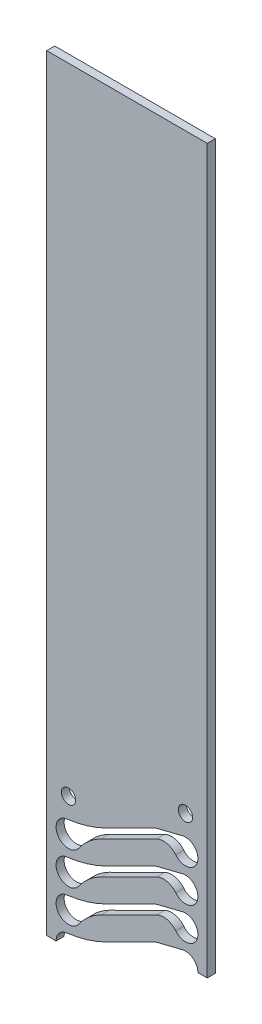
ISO-10303-21;
HEADER;
FILE_DESCRIPTION(('STEP AP214'),'2;1');
FILE_NAME('part.step','',(''),(''),'','','');
FILE_SCHEMA(('AUTOMOTIVE_DESIGN { 1 0 10303 214 1 1 1 1 }'));
ENDSEC;
DATA;
#1=APPLICATION_CONTEXT('core data for automotive mechanical design processes');
#2=APPLICATION_PROTOCOL_DEFINITION('international standard','automotive_design',2000,#1);
#3=PRODUCT_CONTEXT('',#1,'mechanical');
#4=PRODUCT('Part','Part','',(#3));
#5=PRODUCT_RELATED_PRODUCT_CATEGORY('part','',(#4));
#6=PRODUCT_DEFINITION_FORMATION('','',#4);
#7=PRODUCT_DEFINITION_CONTEXT('part definition',#1,'design');
#8=PRODUCT_DEFINITION('design','',#6,#7);
#9=PRODUCT_DEFINITION_SHAPE('','',#8);
#10=(LENGTH_UNIT() NAMED_UNIT(*) SI_UNIT(.MILLI.,.METRE.));
#11=(NAMED_UNIT(*) PLANE_ANGLE_UNIT() SI_UNIT($,.RADIAN.));
#12=(NAMED_UNIT(*) SI_UNIT($,.STERADIAN.) SOLID_ANGLE_UNIT());
#13=UNCERTAINTY_MEASURE_WITH_UNIT(LENGTH_MEASURE(1.E-05),#10,'distance_accuracy_value','');
#14=(GEOMETRIC_REPRESENTATION_CONTEXT(3) GLOBAL_UNCERTAINTY_ASSIGNED_CONTEXT((#13)) GLOBAL_UNIT_ASSIGNED_CONTEXT((#10,
#11,#12)) REPRESENTATION_CONTEXT('',''));
#15=CARTESIAN_POINT('',(0.,0.,0.));
#16=DIRECTION('',(0.,0.,1.));
#17=DIRECTION('',(1.,0.,0.));
#18=AXIS2_PLACEMENT_3D('',#15,#16,#17);
#19=CARTESIAN_POINT('',(23.1849701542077,-57.1691213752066,0.));
#20=DIRECTION('',(0.,0.,1.));
#21=DIRECTION('',(1.,0.,0.));
#22=AXIS2_PLACEMENT_3D('',#19,#20,#21);
#23=CYLINDRICAL_SURFACE('',#22,4.);
#24=DIRECTION('',(0.,0.,1.));
#25=VECTOR('',#24,1.);
#26=CARTESIAN_POINT('',(21.4001789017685,-53.5893839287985,0.));
#27=LINE('',#26,#25);
#28=CARTESIAN_POINT('',(21.4001789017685,-53.5893839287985,0.));
#29=VERTEX_POINT('',#28);
#30=CARTESIAN_POINT('',(21.4001789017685,-53.5893839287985,2.));
#31=VERTEX_POINT('',#30);
#32=EDGE_CURVE('E259',#29,#31,#27,.T.);
#33=ORIENTED_EDGE('',*,*,#32,.F.);
#34=CARTESIAN_POINT('',(23.1849701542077,-57.1691213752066,0.));
#35=DIRECTION('',(0.,0.,1.));
#36=DIRECTION('',(1.,0.,0.));
#37=AXIS2_PLACEMENT_3D('',#34,#35,#36);
#38=CIRCLE('',#37,4.);
#39=CARTESIAN_POINT('',(22.217282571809,-53.2879384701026,0.));
#40=VERTEX_POINT('',#39);
#41=EDGE_CURVE('E20',#40,#29,#38,.T.);
#42=ORIENTED_EDGE('',*,*,#41,.F.);
#43=DIRECTION('',(0.,0.,1.));
#44=VECTOR('',#43,1.);
#45=CARTESIAN_POINT('',(22.217282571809,-53.2879384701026,0.));
#46=LINE('',#45,#44);
#47=CARTESIAN_POINT('',(22.217282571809,-53.2879384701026,2.));
#48=VERTEX_POINT('',#47);
#49=EDGE_CURVE('E397',#48,#40,#46,.F.);
#50=ORIENTED_EDGE('',*,*,#49,.F.);
#51=CARTESIAN_POINT('',(23.1849701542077,-57.1691213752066,2.));
#52=DIRECTION('',(0.,0.,1.));
#53=DIRECTION('',(1.,0.,0.));
#54=AXIS2_PLACEMENT_3D('',#51,#52,#53);
#55=CIRCLE('',#54,4.);
#56=EDGE_CURVE('E260',#31,#48,#55,.F.);
#57=ORIENTED_EDGE('',*,*,#56,.F.);
#58=EDGE_LOOP('',(#33,#42,#50,#57));
#59=FACE_BOUND('',#58,.T.);
#60=ADVANCED_FACE('F17',(#59),#23,.F.);
#61=CARTESIAN_POINT('',(23.1849701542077,-32.5691213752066,0.));
#62=DIRECTION('',(0.,0.,1.));
#63=DIRECTION('',(1.,0.,0.));
#64=AXIS2_PLACEMENT_3D('',#61,#62,#63);
#65=CYLINDRICAL_SURFACE('',#64,4.);
#66=DIRECTION('',(0.,0.,1.));
#67=VECTOR('',#66,1.);
#68=CARTESIAN_POINT('',(22.217282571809,-28.6879384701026,0.));
#69=LINE('',#68,#67);
#70=CARTESIAN_POINT('',(22.217282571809,-28.6879384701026,0.));
#71=VERTEX_POINT('',#70);
#72=CARTESIAN_POINT('',(22.217282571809,-28.6879384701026,2.));
#73=VERTEX_POINT('',#72);
#74=EDGE_CURVE('E363',#71,#73,#69,.T.);
#75=ORIENTED_EDGE('',*,*,#74,.T.);
#76=CARTESIAN_POINT('',(23.1849701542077,-32.5691213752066,2.));
#77=DIRECTION('',(0.,0.,1.));
#78=DIRECTION('',(1.,0.,0.));
#79=AXIS2_PLACEMENT_3D('',#76,#77,#78);
#80=CIRCLE('',#79,4.);
#81=CARTESIAN_POINT('',(21.4001789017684,-28.9893839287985,2.));
#82=VERTEX_POINT('',#81);
#83=EDGE_CURVE('E567',#82,#73,#80,.F.);
#84=ORIENTED_EDGE('',*,*,#83,.F.);
#85=DIRECTION('',(0.,0.,1.));
#86=VECTOR('',#85,1.);
#87=CARTESIAN_POINT('',(21.4001789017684,-28.9893839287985,0.));
#88=LINE('',#87,#86);
#89=CARTESIAN_POINT('',(21.4001789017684,-28.9893839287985,0.));
#90=VERTEX_POINT('',#89);
#91=EDGE_CURVE('E366',#82,#90,#88,.F.);
#92=ORIENTED_EDGE('',*,*,#91,.T.);
#93=CARTESIAN_POINT('',(23.1849701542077,-32.5691213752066,0.));
#94=DIRECTION('',(0.,0.,1.));
#95=DIRECTION('',(1.,0.,0.));
#96=AXIS2_PLACEMENT_3D('',#93,#94,#95);
#97=CIRCLE('',#96,4.);
#98=EDGE_CURVE('E257',#71,#90,#97,.T.);
#99=ORIENTED_EDGE('',*,*,#98,.F.);
#100=EDGE_LOOP('',(#75,#84,#92,#99));
#101=FACE_BOUND('',#100,.T.);
#102=ADVANCED_FACE('F585',(#101),#65,.F.);
#103=CARTESIAN_POINT('',(23.1849701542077,-40.7691213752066,0.));
#104=DIRECTION('',(0.,0.,1.));
#105=DIRECTION('',(1.,0.,0.));
#106=AXIS2_PLACEMENT_3D('',#103,#104,#105);
#107=CYLINDRICAL_SURFACE('',#106,4.);
#108=DIRECTION('',(0.,0.,1.));
#109=VECTOR('',#108,1.);
#110=CARTESIAN_POINT('',(22.217282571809,-36.8879384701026,0.));
#111=LINE('',#110,#109);
#112=CARTESIAN_POINT('',(22.217282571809,-36.8879384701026,0.));
#113=VERTEX_POINT('',#112);
#114=CARTESIAN_POINT('',(22.217282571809,-36.8879384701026,2.));
#115=VERTEX_POINT('',#114);
#116=EDGE_CURVE('E331',#113,#115,#111,.T.);
#117=ORIENTED_EDGE('',*,*,#116,.T.);
#118=CARTESIAN_POINT('',(23.1849701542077,-40.7691213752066,2.));
#119=DIRECTION('',(0.,0.,1.));
#120=DIRECTION('',(1.,0.,0.));
#121=AXIS2_PLACEMENT_3D('',#118,#119,#120);
#122=CIRCLE('',#121,4.);
#123=CARTESIAN_POINT('',(21.4001789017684,-37.1893839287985,2.));
#124=VERTEX_POINT('',#123);
#125=EDGE_CURVE('E565',#124,#115,#122,.F.);
#126=ORIENTED_EDGE('',*,*,#125,.F.);
#127=DIRECTION('',(0.,0.,1.));
#128=VECTOR('',#127,1.);
#129=CARTESIAN_POINT('',(21.4001789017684,-37.1893839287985,0.));
#130=LINE('',#129,#128);
#131=CARTESIAN_POINT('',(21.4001789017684,-37.1893839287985,0.));
#132=VERTEX_POINT('',#131);
#133=EDGE_CURVE('E334',#124,#132,#130,.F.);
#134=ORIENTED_EDGE('',*,*,#133,.T.);
#135=CARTESIAN_POINT('',(23.1849701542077,-40.7691213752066,0.));
#136=DIRECTION('',(0.,0.,1.));
#137=DIRECTION('',(1.,0.,0.));
#138=AXIS2_PLACEMENT_3D('',#135,#136,#137);
#139=CIRCLE('',#138,4.);
#140=EDGE_CURVE('E572',#113,#132,#139,.T.);
#141=ORIENTED_EDGE('',*,*,#140,.F.);
#142=EDGE_LOOP('',(#117,#126,#134,#141));
#143=FACE_BOUND('',#142,.T.);
#144=ADVANCED_FACE('F772',(#143),#107,.F.);
#145=CARTESIAN_POINT('',(23.1849701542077,-48.9691213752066,0.));
#146=DIRECTION('',(0.,0.,1.));
#147=DIRECTION('',(1.,0.,0.));
#148=AXIS2_PLACEMENT_3D('',#145,#146,#147);
#149=CYLINDRICAL_SURFACE('',#148,4.);
#150=DIRECTION('',(0.,0.,1.));
#151=VECTOR('',#150,1.);
#152=CARTESIAN_POINT('',(22.217282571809,-45.0879384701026,0.));
#153=LINE('',#152,#151);
#154=CARTESIAN_POINT('',(22.217282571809,-45.0879384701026,0.));
#155=VERTEX_POINT('',#154);
#156=CARTESIAN_POINT('',(22.217282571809,-45.0879384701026,2.));
#157=VERTEX_POINT('',#156);
#158=EDGE_CURVE('E299',#155,#157,#153,.T.);
#159=ORIENTED_EDGE('',*,*,#158,.T.);
#160=CARTESIAN_POINT('',(23.1849701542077,-48.9691213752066,2.));
#161=DIRECTION('',(0.,0.,1.));
#162=DIRECTION('',(1.,0.,0.));
#163=AXIS2_PLACEMENT_3D('',#160,#161,#162);
#164=CIRCLE('',#163,4.);
#165=CARTESIAN_POINT('',(21.4001789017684,-45.3893839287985,2.));
#166=VERTEX_POINT('',#165);
#167=EDGE_CURVE('E448',#166,#157,#164,.F.);
#168=ORIENTED_EDGE('',*,*,#167,.F.);
#169=DIRECTION('',(0.,0.,1.));
#170=VECTOR('',#169,1.);
#171=CARTESIAN_POINT('',(21.4001789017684,-45.3893839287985,0.));
#172=LINE('',#171,#170);
#173=CARTESIAN_POINT('',(21.4001789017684,-45.3893839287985,0.));
#174=VERTEX_POINT('',#173);
#175=EDGE_CURVE('E302',#166,#174,#172,.F.);
#176=ORIENTED_EDGE('',*,*,#175,.T.);
#177=CARTESIAN_POINT('',(23.1849701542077,-48.9691213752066,0.));
#178=DIRECTION('',(0.,0.,1.));
#179=DIRECTION('',(1.,0.,0.));
#180=AXIS2_PLACEMENT_3D('',#177,#178,#179);
#181=CIRCLE('',#180,4.);
#182=EDGE_CURVE('E570',#155,#174,#181,.T.);
#183=ORIENTED_EDGE('',*,*,#182,.F.);
#184=EDGE_LOOP('',(#159,#168,#176,#183));
#185=FACE_BOUND('',#184,.T.);
#186=ADVANCED_FACE('F764',(#185),#149,.F.);
#187=CARTESIAN_POINT('',(14.0980269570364,31.6493704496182,2.));
#188=DIRECTION('',(0.,0.,1.));
#189=DIRECTION('',(1.,0.,0.));
#190=AXIS2_PLACEMENT_3D('',#187,#188,#189);
#191=PLANE('',#190);
#192=CARTESIAN_POINT('',(23.6980574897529,-50.9481062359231,2.));
#193=DIRECTION('',(0.,0.,1.));
#194=DIRECTION('',(1.,0.,0.));
#195=AXIS2_PLACEMENT_3D('',#192,#193,#194);
#196=CIRCLE('',#195,3.9);
#197=CARTESIAN_POINT('',(21.9578860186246,-47.4578622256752,2.));
#198=VERTEX_POINT('',#197);
#199=CARTESIAN_POINT('',(26.73433281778,-48.5004477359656,2.));
#200=VERTEX_POINT('',#199);
#201=EDGE_CURVE('E293',#198,#200,#196,.F.);
#202=ORIENTED_EDGE('',*,*,#201,.F.);
#203=DIRECTION('',(0.894934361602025,0.446197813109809,0.));
#204=VECTOR('',#203,1.);
#205=CARTESIAN_POINT('',(8.14159624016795,-54.3464102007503,2.));
#206=LINE('',#205,#204);
#207=CARTESIAN_POINT('',(8.14159624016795,-54.3464102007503,2.));
#208=VERTEX_POINT('',#207);
#209=EDGE_CURVE('E287',#198,#208,#206,.F.);
#210=ORIENTED_EDGE('',*,*,#209,.T.);
#211=CARTESIAN_POINT('',(14.8345634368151,-67.7704256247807,2.));
#212=DIRECTION('',(0.,0.,1.));
#213=DIRECTION('',(1.,0.,0.));
#214=AXIS2_PLACEMENT_3D('',#211,#212,#213);
#215=CIRCLE('',#214,15.);
#216=CARTESIAN_POINT('',(2.54072633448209,-59.1761502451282,2.));
#217=VERTEX_POINT('',#216);
#218=EDGE_CURVE('E283',#217,#208,#215,.F.);
#219=ORIENTED_EDGE('',*,*,#218,.F.);
#220=CARTESIAN_POINT('',(0.,-57.4,2.));
#221=DIRECTION('',(0.,0.,1.));
#222=DIRECTION('',(1.,0.,0.));
#223=AXIS2_PLACEMENT_3D('',#220,#221,#222);
#224=CIRCLE('',#223,3.1);
#225=CARTESIAN_POINT('',(-0.377395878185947,-54.3230579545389,2.));
#226=VERTEX_POINT('',#225);
#227=EDGE_CURVE('E314',#217,#226,#224,.F.);
#228=ORIENTED_EDGE('',*,*,#227,.T.);
#229=CARTESIAN_POINT('',(-4.02961405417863,-24.5461994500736,2.));
#230=DIRECTION('',(0.,0.,1.));
#231=DIRECTION('',(1.,0.,0.));
#232=AXIS2_PLACEMENT_3D('',#229,#230,#231);
#233=CIRCLE('',#232,30.);
#234=CARTESIAN_POINT('',(9.3563203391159,-51.3942302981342,2.));
#235=VERTEX_POINT('',#234);
#236=EDGE_CURVE('E311',#235,#226,#233,.F.);
#237=ORIENTED_EDGE('',*,*,#236,.F.);
#238=DIRECTION('',(-0.894934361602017,-0.446197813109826,0.));
#239=VECTOR('',#238,1.);
#240=CARTESIAN_POINT('',(21.4001789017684,-45.3893839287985,2.));
#241=LINE('',#240,#239);
#242=EDGE_CURVE('E306',#235,#166,#241,.F.);
#243=ORIENTED_EDGE('',*,*,#242,.T.);
#244=ORIENTED_EDGE('',*,*,#167,.T.);
#245=DIRECTION('',(-0.970295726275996,-0.241921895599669,0.));
#246=VECTOR('',#245,1.);
#247=CARTESIAN_POINT('',(28.3978245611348,-43.5469562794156,2.));
#248=LINE('',#247,#246);
#249=CARTESIAN_POINT('',(28.3978245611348,-43.5469562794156,2.));
#250=VERTEX_POINT('',#249);
#251=EDGE_CURVE('E298',#157,#250,#248,.F.);
#252=ORIENTED_EDGE('',*,*,#251,.T.);
#253=CARTESIAN_POINT('',(29.1477824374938,-46.5548730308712,2.));
#254=DIRECTION('',(0.,0.,1.));
#255=DIRECTION('',(1.,0.,0.));
#256=AXIS2_PLACEMENT_3D('',#253,#254,#255);
#257=CIRCLE('',#256,3.1);
#258=EDGE_CURVE('E297',#250,#200,#257,.F.);
#259=ORIENTED_EDGE('',*,*,#258,.T.);
#260=EDGE_LOOP('',(#202,#210,#219,#228,#237,#243,#244,#252,#259));
#261=FACE_BOUND('',#260,.T.);
#262=CARTESIAN_POINT('',(23.6980574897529,-42.7481062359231,2.));
#263=DIRECTION('',(0.,0.,1.));
#264=DIRECTION('',(1.,0.,0.));
#265=AXIS2_PLACEMENT_3D('',#262,#263,#264);
#266=CIRCLE('',#265,3.9);
#267=CARTESIAN_POINT('',(21.9578860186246,-39.2578622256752,2.));
#268=VERTEX_POINT('',#267);
#269=CARTESIAN_POINT('',(26.7343328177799,-40.3004477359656,2.));
#270=VERTEX_POINT('',#269);
#271=EDGE_CURVE('E325',#268,#270,#266,.F.);
#272=ORIENTED_EDGE('',*,*,#271,.F.);
#273=DIRECTION('',(0.894934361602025,0.446197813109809,0.));
#274=VECTOR('',#273,1.);
#275=CARTESIAN_POINT('',(8.14159624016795,-46.1464102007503,2.));
#276=LINE('',#275,#274);
#277=CARTESIAN_POINT('',(8.14159624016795,-46.1464102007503,2.));
#278=VERTEX_POINT('',#277);
#279=EDGE_CURVE('E319',#268,#278,#276,.F.);
#280=ORIENTED_EDGE('',*,*,#279,.T.);
#281=CARTESIAN_POINT('',(14.8345634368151,-59.5704256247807,2.));
#282=DIRECTION('',(0.,0.,1.));
#283=DIRECTION('',(1.,0.,0.));
#284=AXIS2_PLACEMENT_3D('',#281,#282,#283);
#285=CIRCLE('',#284,15.);
#286=CARTESIAN_POINT('',(2.54072633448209,-50.9761502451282,2.));
#287=VERTEX_POINT('',#286);
#288=EDGE_CURVE('E315',#287,#278,#285,.F.);
#289=ORIENTED_EDGE('',*,*,#288,.F.);
#290=CARTESIAN_POINT('',(0.,-49.2,2.));
#291=DIRECTION('',(0.,0.,1.));
#292=DIRECTION('',(1.,0.,0.));
#293=AXIS2_PLACEMENT_3D('',#290,#291,#292);
#294=CIRCLE('',#293,3.1);
#295=CARTESIAN_POINT('',(-0.377395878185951,-46.1230579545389,2.));
#296=VERTEX_POINT('',#295);
#297=EDGE_CURVE('E346',#287,#296,#294,.F.);
#298=ORIENTED_EDGE('',*,*,#297,.T.);
#299=CARTESIAN_POINT('',(-4.02961405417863,-16.3461994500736,2.));
#300=DIRECTION('',(0.,0.,1.));
#301=DIRECTION('',(1.,0.,0.));
#302=AXIS2_PLACEMENT_3D('',#299,#300,#301);
#303=CIRCLE('',#302,30.);
#304=CARTESIAN_POINT('',(9.3563203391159,-43.1942302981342,2.));
#305=VERTEX_POINT('',#304);
#306=EDGE_CURVE('E343',#305,#296,#303,.F.);
#307=ORIENTED_EDGE('',*,*,#306,.F.);
#308=DIRECTION('',(-0.894934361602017,-0.446197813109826,0.));
#309=VECTOR('',#308,1.);
#310=CARTESIAN_POINT('',(21.4001789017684,-37.1893839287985,2.));
#311=LINE('',#310,#309);
#312=EDGE_CURVE('E338',#305,#124,#311,.F.);
#313=ORIENTED_EDGE('',*,*,#312,.T.);
#314=ORIENTED_EDGE('',*,*,#125,.T.);
#315=DIRECTION('',(-0.970295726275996,-0.241921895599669,0.));
#316=VECTOR('',#315,1.);
#317=CARTESIAN_POINT('',(28.3978245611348,-35.3469562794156,2.));
#318=LINE('',#317,#316);
#319=CARTESIAN_POINT('',(28.3978245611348,-35.3469562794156,2.));
#320=VERTEX_POINT('',#319);
#321=EDGE_CURVE('E330',#115,#320,#318,.F.);
#322=ORIENTED_EDGE('',*,*,#321,.T.);
#323=CARTESIAN_POINT('',(29.1477824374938,-38.3548730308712,2.));
#324=DIRECTION('',(0.,0.,1.));
#325=DIRECTION('',(1.,0.,0.));
#326=AXIS2_PLACEMENT_3D('',#323,#324,#325);
#327=CIRCLE('',#326,3.1);
#328=EDGE_CURVE('E329',#320,#270,#327,.F.);
#329=ORIENTED_EDGE('',*,*,#328,.T.);
#330=EDGE_LOOP('',(#272,#280,#289,#298,#307,#313,#314,#322,#329));
#331=FACE_BOUND('',#330,.T.);
#332=CARTESIAN_POINT('',(23.6980574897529,-34.5481062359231,2.));
#333=DIRECTION('',(0.,0.,1.));
#334=DIRECTION('',(1.,0.,0.));
#335=AXIS2_PLACEMENT_3D('',#332,#333,#334);
#336=CIRCLE('',#335,3.9);
#337=CARTESIAN_POINT('',(21.9578860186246,-31.0578622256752,2.));
#338=VERTEX_POINT('',#337);
#339=CARTESIAN_POINT('',(26.7343328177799,-32.1004477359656,2.));
#340=VERTEX_POINT('',#339);
#341=EDGE_CURVE('E357',#338,#340,#336,.F.);
#342=ORIENTED_EDGE('',*,*,#341,.F.);
#343=DIRECTION('',(0.894934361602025,0.446197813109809,0.));
#344=VECTOR('',#343,1.);
#345=CARTESIAN_POINT('',(8.14159624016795,-37.9464102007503,2.));
#346=LINE('',#345,#344);
#347=CARTESIAN_POINT('',(8.14159624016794,-37.9464102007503,2.));
#348=VERTEX_POINT('',#347);
#349=EDGE_CURVE('E351',#338,#348,#346,.F.);
#350=ORIENTED_EDGE('',*,*,#349,.T.);
#351=CARTESIAN_POINT('',(14.8345634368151,-51.3704256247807,2.));
#352=DIRECTION('',(0.,0.,1.));
#353=DIRECTION('',(1.,0.,0.));
#354=AXIS2_PLACEMENT_3D('',#351,#352,#353);
#355=CIRCLE('',#354,15.);
#356=CARTESIAN_POINT('',(2.54072633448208,-42.7761502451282,2.));
#357=VERTEX_POINT('',#356);
#358=EDGE_CURVE('E347',#357,#348,#355,.F.);
#359=ORIENTED_EDGE('',*,*,#358,.F.);
#360=CARTESIAN_POINT('',(0.,-41.,2.));
#361=DIRECTION('',(0.,0.,1.));
#362=DIRECTION('',(1.,0.,0.));
#363=AXIS2_PLACEMENT_3D('',#360,#361,#362);
#364=CIRCLE('',#363,3.1);
#365=CARTESIAN_POINT('',(-0.377395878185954,-37.9230579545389,2.));
#366=VERTEX_POINT('',#365);
#367=EDGE_CURVE('E551',#357,#366,#364,.F.);
#368=ORIENTED_EDGE('',*,*,#367,.T.);
#369=CARTESIAN_POINT('',(-4.02961405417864,-8.14619945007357,2.));
#370=DIRECTION('',(0.,0.,1.));
#371=DIRECTION('',(1.,0.,0.));
#372=AXIS2_PLACEMENT_3D('',#369,#370,#371);
#373=CIRCLE('',#372,30.);
#374=CARTESIAN_POINT('',(9.35632033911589,-34.9942302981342,2.));
#375=VERTEX_POINT('',#374);
#376=EDGE_CURVE('E375',#375,#366,#373,.F.);
#377=ORIENTED_EDGE('',*,*,#376,.F.);
#378=DIRECTION('',(-0.894934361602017,-0.446197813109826,0.));
#379=VECTOR('',#378,1.);
#380=CARTESIAN_POINT('',(21.4001789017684,-28.9893839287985,2.));
#381=LINE('',#380,#379);
#382=EDGE_CURVE('E370',#375,#82,#381,.F.);
#383=ORIENTED_EDGE('',*,*,#382,.T.);
#384=ORIENTED_EDGE('',*,*,#83,.T.);
#385=DIRECTION('',(-0.970295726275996,-0.241921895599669,0.));
#386=VECTOR('',#385,1.);
#387=CARTESIAN_POINT('',(28.3978245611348,-27.1469562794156,2.));
#388=LINE('',#387,#386);
#389=CARTESIAN_POINT('',(28.3978245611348,-27.1469562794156,2.));
#390=VERTEX_POINT('',#389);
#391=EDGE_CURVE('E362',#73,#390,#388,.F.);
#392=ORIENTED_EDGE('',*,*,#391,.T.);
#393=CARTESIAN_POINT('',(29.1477824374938,-30.1548730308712,2.));
#394=DIRECTION('',(0.,0.,1.));
#395=DIRECTION('',(1.,0.,0.));
#396=AXIS2_PLACEMENT_3D('',#393,#394,#395);
#397=CIRCLE('',#396,3.1);
#398=EDGE_CURVE('E361',#390,#340,#397,.F.);
#399=ORIENTED_EDGE('',*,*,#398,.T.);
#400=EDGE_LOOP('',(#342,#350,#359,#368,#377,#383,#384,#392,#399));
#401=FACE_BOUND('',#400,.T.);
#402=CARTESIAN_POINT('',(0.,-32.8,2.));
#403=DIRECTION('',(0.,0.,1.));
#404=DIRECTION('',(1.,0.,0.));
#405=AXIS2_PLACEMENT_3D('',#402,#403,#404);
#406=CIRCLE('',#405,1.783);
#407=CARTESIAN_POINT('',(1.78299999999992,-32.8,2.));
#408=VERTEX_POINT('',#407);
#409=EDGE_CURVE('E554',#408,#408,#406,.F.);
#410=ORIENTED_EDGE('',*,*,#409,.T.);
#411=EDGE_LOOP('',(#410));
#412=FACE_BOUND('',#411,.T.);
#413=CARTESIAN_POINT('',(29.1477824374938,-21.9548730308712,2.));
#414=DIRECTION('',(0.,0.,1.));
#415=DIRECTION('',(1.,0.,0.));
#416=AXIS2_PLACEMENT_3D('',#413,#414,#415);
#417=CIRCLE('',#416,1.783);
#418=CARTESIAN_POINT('',(30.9307824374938,-21.9548730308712,2.));
#419=VERTEX_POINT('',#418);
#420=EDGE_CURVE('E421',#419,#419,#417,.F.);
#421=ORIENTED_EDGE('',*,*,#420,.T.);
#422=EDGE_LOOP('',(#421));
#423=FACE_BOUND('',#422,.T.);
#424=CARTESIAN_POINT('',(29.1477824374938,-54.7548730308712,2.));
#425=DIRECTION('',(0.,0.,1.));
#426=DIRECTION('',(1.,0.,0.));
#427=AXIS2_PLACEMENT_3D('',#424,#425,#426);
#428=CIRCLE('',#427,3.1);
#429=CARTESIAN_POINT('',(28.3978245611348,-51.7469562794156,2.));
#430=VERTEX_POINT('',#429);
#431=CARTESIAN_POINT('',(32.2477824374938,-54.7548730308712,2.));
#432=VERTEX_POINT('',#431);
#433=EDGE_CURVE('E396',#430,#432,#428,.F.);
#434=ORIENTED_EDGE('',*,*,#433,.T.);
#435=DIRECTION('',(1.,0.,0.));
#436=VECTOR('',#435,1.);
#437=CARTESIAN_POINT('',(34.5738912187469,-54.7548730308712,2.));
#438=LINE('',#437,#436);
#439=CARTESIAN_POINT('',(34.5738912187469,-54.7548730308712,2.));
#440=VERTEX_POINT('',#439);
#441=EDGE_CURVE('E379',#440,#432,#438,.F.);
#442=ORIENTED_EDGE('',*,*,#441,.F.);
#443=DIRECTION('',(0.,1.,0.));
#444=VECTOR('',#443,1.);
#445=CARTESIAN_POINT('',(34.5738912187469,125.4,2.));
#446=LINE('',#445,#444);
#447=CARTESIAN_POINT('',(34.5738912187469,125.4,2.));
#448=VERTEX_POINT('',#447);
#449=EDGE_CURVE('E378',#448,#440,#446,.F.);
#450=ORIENTED_EDGE('',*,*,#449,.F.);
#451=DIRECTION('',(1.,0.,0.));
#452=VECTOR('',#451,1.);
#453=CARTESIAN_POINT('',(-5.42610878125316,125.4,2.));
#454=LINE('',#453,#452);
#455=CARTESIAN_POINT('',(-5.42610878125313,125.4,2.));
#456=VERTEX_POINT('',#455);
#457=EDGE_CURVE('E390',#456,#448,#454,.T.);
#458=ORIENTED_EDGE('',*,*,#457,.F.);
#459=DIRECTION('',(0.,1.,0.));
#460=VECTOR('',#459,1.);
#461=CARTESIAN_POINT('',(-5.42610878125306,-65.6,2.));
#462=LINE('',#461,#460);
#463=CARTESIAN_POINT('',(-5.42610878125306,-65.6,2.));
#464=VERTEX_POINT('',#463);
#465=EDGE_CURVE('E445',#464,#456,#462,.T.);
#466=ORIENTED_EDGE('',*,*,#465,.F.);
#467=DIRECTION('',(1.,0.,0.));
#468=VECTOR('',#467,1.);
#469=CARTESIAN_POINT('',(-3.10000000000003,-65.6,2.));
#470=LINE('',#469,#468);
#471=CARTESIAN_POINT('',(-3.10000000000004,-65.6,2.));
#472=VERTEX_POINT('',#471);
#473=EDGE_CURVE('E411',#472,#464,#470,.F.);
#474=ORIENTED_EDGE('',*,*,#473,.F.);
#475=CARTESIAN_POINT('',(0.,-65.6,2.));
#476=DIRECTION('',(0.,0.,1.));
#477=DIRECTION('',(1.,0.,0.));
#478=AXIS2_PLACEMENT_3D('',#475,#476,#477);
#479=CIRCLE('',#478,3.1);
#480=CARTESIAN_POINT('',(-0.377395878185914,-62.5230579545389,2.));
#481=VERTEX_POINT('',#480);
#482=EDGE_CURVE('E407',#472,#481,#479,.F.);
#483=ORIENTED_EDGE('',*,*,#482,.T.);
#484=CARTESIAN_POINT('',(-4.0296140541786,-32.7461994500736,2.));
#485=DIRECTION('',(0.,0.,1.));
#486=DIRECTION('',(1.,0.,0.));
#487=AXIS2_PLACEMENT_3D('',#484,#485,#486);
#488=CIRCLE('',#487,30.);
#489=CARTESIAN_POINT('',(9.35632033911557,-59.5942302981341,2.));
#490=VERTEX_POINT('',#489);
#491=EDGE_CURVE('E403',#490,#481,#488,.F.);
#492=ORIENTED_EDGE('',*,*,#491,.F.);
#493=DIRECTION('',(0.894934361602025,0.446197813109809,0.));
#494=VECTOR('',#493,1.);
#495=CARTESIAN_POINT('',(21.4001789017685,-53.5893839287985,2.));
#496=LINE('',#495,#494);
#497=EDGE_CURVE('E399',#31,#490,#496,.F.);
#498=ORIENTED_EDGE('',*,*,#497,.F.);
#499=ORIENTED_EDGE('',*,*,#56,.T.);
#500=DIRECTION('',(0.970295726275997,0.241921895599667,0.));
#501=VECTOR('',#500,1.);
#502=CARTESIAN_POINT('',(28.3978245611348,-51.7469562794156,2.));
#503=LINE('',#502,#501);
#504=EDGE_CURVE('E263',#430,#48,#503,.F.);
#505=ORIENTED_EDGE('',*,*,#504,.F.);
#506=EDGE_LOOP('',(#434,#442,#450,#458,#466,#474,#483,#492,#498,#499,#505));
#507=FACE_BOUND('',#506,.T.);
#508=ADVANCED_FACE('F608',(#261,#331,#401,#412,#423,#507),#191,.T.);
#509=CARTESIAN_POINT('',(-5.42610878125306,-65.6,0.));
#510=DIRECTION('',(-1.,0.,0.));
#511=DIRECTION('',(0.,0.,1.));
#512=AXIS2_PLACEMENT_3D('',#509,#510,#511);
#513=PLANE('',#512);
#514=DIRECTION('',(0.,1.,0.));
#515=VECTOR('',#514,1.);
#516=CARTESIAN_POINT('',(-5.42610878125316,31.6493704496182,0.));
#517=LINE('',#516,#515);
#518=CARTESIAN_POINT('',(-5.42610878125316,125.4,0.));
#519=VERTEX_POINT('',#518);
#520=CARTESIAN_POINT('',(-5.42610878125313,-65.6000000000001,0.));
#521=VERTEX_POINT('',#520);
#522=EDGE_CURVE('E279',#519,#521,#517,.F.);
#523=ORIENTED_EDGE('',*,*,#522,.T.);
#524=DIRECTION('',(0.,0.,-1.));
#525=VECTOR('',#524,1.);
#526=CARTESIAN_POINT('',(-5.42610878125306,-65.6,0.));
#527=LINE('',#526,#525);
#528=EDGE_CURVE('E408',#464,#521,#527,.T.);
#529=ORIENTED_EDGE('',*,*,#528,.F.);
#530=ORIENTED_EDGE('',*,*,#465,.T.);
#531=DIRECTION('',(0.,0.,1.));
#532=VECTOR('',#531,1.);
#533=CARTESIAN_POINT('',(-5.42610878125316,125.4,0.));
#534=LINE('',#533,#532);
#535=EDGE_CURVE('E418',#519,#456,#534,.T.);
#536=ORIENTED_EDGE('',*,*,#535,.F.);
#537=EDGE_LOOP('',(#523,#529,#530,#536));
#538=FACE_BOUND('',#537,.T.);
#539=ADVANCED_FACE('F627',(#538),#513,.T.);
#540=CARTESIAN_POINT('',(-3.10000000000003,-65.6,0.));
#541=DIRECTION('',(0.,-1.,0.));
#542=DIRECTION('',(0.,0.,-1.));
#543=AXIS2_PLACEMENT_3D('',#540,#541,#542);
#544=PLANE('',#543);
#545=DIRECTION('',(1.,0.,0.));
#546=VECTOR('',#545,1.);
#547=CARTESIAN_POINT('',(14.0980269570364,-65.6000000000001,0.));
#548=LINE('',#547,#546);
#549=CARTESIAN_POINT('',(-3.10000000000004,-65.6000000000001,0.));
#550=VERTEX_POINT('',#549);
#551=EDGE_CURVE('E276',#521,#550,#548,.T.);
#552=ORIENTED_EDGE('',*,*,#551,.T.);
#553=DIRECTION('',(0.,0.,1.));
#554=VECTOR('',#553,1.);
#555=CARTESIAN_POINT('',(-3.10000000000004,-65.6,0.));
#556=LINE('',#555,#554);
#557=EDGE_CURVE('E404',#550,#472,#556,.T.);
#558=ORIENTED_EDGE('',*,*,#557,.T.);
#559=ORIENTED_EDGE('',*,*,#473,.T.);
#560=ORIENTED_EDGE('',*,*,#528,.T.);
#561=EDGE_LOOP('',(#552,#558,#559,#560));
#562=FACE_BOUND('',#561,.T.);
#563=ADVANCED_FACE('F620',(#562),#544,.T.);
#564=CARTESIAN_POINT('',(0.,-65.6,0.));
#565=DIRECTION('',(0.,0.,1.));
#566=DIRECTION('',(1.,0.,0.));
#567=AXIS2_PLACEMENT_3D('',#564,#565,#566);
#568=CYLINDRICAL_SURFACE('',#567,3.1);
#569=ORIENTED_EDGE('',*,*,#557,.F.);
#570=CARTESIAN_POINT('',(0.,-65.6,0.));
#571=DIRECTION('',(0.,0.,1.));
#572=DIRECTION('',(1.,0.,0.));
#573=AXIS2_PLACEMENT_3D('',#570,#571,#572);
#574=CIRCLE('',#573,3.1);
#575=CARTESIAN_POINT('',(-0.377395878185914,-62.5230579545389,0.));
#576=VERTEX_POINT('',#575);
#577=EDGE_CURVE('E272',#550,#576,#574,.F.);
#578=ORIENTED_EDGE('',*,*,#577,.T.);
#579=DIRECTION('',(0.,0.,1.));
#580=VECTOR('',#579,1.);
#581=CARTESIAN_POINT('',(-0.377395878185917,-62.5230579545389,0.));
#582=LINE('',#581,#580);
#583=EDGE_CURVE('E401',#481,#576,#582,.F.);
#584=ORIENTED_EDGE('',*,*,#583,.F.);
#585=ORIENTED_EDGE('',*,*,#482,.F.);
#586=EDGE_LOOP('',(#569,#578,#584,#585));
#587=FACE_BOUND('',#586,.T.);
#588=ADVANCED_FACE('F618',(#587),#568,.F.);
#589=CARTESIAN_POINT('',(-4.0296140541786,-32.7461994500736,0.));
#590=DIRECTION('',(0.,0.,1.));
#591=DIRECTION('',(1.,0.,0.));
#592=AXIS2_PLACEMENT_3D('',#589,#590,#591);
#593=CYLINDRICAL_SURFACE('',#592,30.);
#594=CARTESIAN_POINT('',(-4.0296140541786,-32.7461994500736,0.));
#595=DIRECTION('',(0.,0.,1.));
#596=DIRECTION('',(1.,0.,0.));
#597=AXIS2_PLACEMENT_3D('',#594,#595,#596);
#598=CIRCLE('',#597,30.);
#599=CARTESIAN_POINT('',(9.35632033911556,-59.5942302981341,0.));
#600=VERTEX_POINT('',#599);
#601=EDGE_CURVE('E268',#576,#600,#598,.T.);
#602=ORIENTED_EDGE('',*,*,#601,.T.);
#603=DIRECTION('',(0.,0.,1.));
#604=VECTOR('',#603,1.);
#605=CARTESIAN_POINT('',(9.35632033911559,-59.5942302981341,0.));
#606=LINE('',#605,#604);
#607=EDGE_CURVE('E264',#490,#600,#606,.F.);
#608=ORIENTED_EDGE('',*,*,#607,.F.);
#609=ORIENTED_EDGE('',*,*,#491,.T.);
#610=ORIENTED_EDGE('',*,*,#583,.T.);
#611=EDGE_LOOP('',(#602,#608,#609,#610));
#612=FACE_BOUND('',#611,.T.);
#613=ADVANCED_FACE('F614',(#612),#593,.T.);
#614=CARTESIAN_POINT('',(21.4001789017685,-53.5893839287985,0.));
#615=DIRECTION('',(0.446197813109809,-0.894934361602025,0.));
#616=DIRECTION('',(0.894934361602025,0.446197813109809,0.));
#617=AXIS2_PLACEMENT_3D('',#614,#615,#616);
#618=PLANE('',#617);
#619=DIRECTION('',(0.894934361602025,0.446197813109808,0.));
#620=VECTOR('',#619,1.);
#621=CARTESIAN_POINT('',(9.35632033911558,-59.5942302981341,0.));
#622=LINE('',#621,#620);
#623=EDGE_CURVE('E252',#600,#29,#622,.T.);
#624=ORIENTED_EDGE('',*,*,#623,.T.);
#625=ORIENTED_EDGE('',*,*,#32,.T.);
#626=ORIENTED_EDGE('',*,*,#497,.T.);
#627=ORIENTED_EDGE('',*,*,#607,.T.);
#628=EDGE_LOOP('',(#624,#625,#626,#627));
#629=FACE_BOUND('',#628,.T.);
#630=ADVANCED_FACE('F266',(#629),#618,.T.);
#631=CARTESIAN_POINT('',(28.3978245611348,-51.7469562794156,0.));
#632=DIRECTION('',(0.241921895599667,-0.970295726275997,0.));
#633=DIRECTION('',(0.970295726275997,0.241921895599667,0.));
#634=AXIS2_PLACEMENT_3D('',#631,#632,#633);
#635=PLANE('',#634);
#636=DIRECTION('',(0.970295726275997,0.241921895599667,0.));
#637=VECTOR('',#636,1.);
#638=CARTESIAN_POINT('',(22.217282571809,-53.2879384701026,0.));
#639=LINE('',#638,#637);
#640=CARTESIAN_POINT('',(28.3978245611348,-51.7469562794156,0.));
#641=VERTEX_POINT('',#640);
#642=EDGE_CURVE('E256',#40,#641,#639,.T.);
#643=ORIENTED_EDGE('',*,*,#642,.T.);
#644=DIRECTION('',(0.,0.,1.));
#645=VECTOR('',#644,1.);
#646=CARTESIAN_POINT('',(28.3978245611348,-51.7469562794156,0.));
#647=LINE('',#646,#645);
#648=EDGE_CURVE('E393',#641,#430,#647,.T.);
#649=ORIENTED_EDGE('',*,*,#648,.T.);
#650=ORIENTED_EDGE('',*,*,#504,.T.);
#651=ORIENTED_EDGE('',*,*,#49,.T.);
#652=EDGE_LOOP('',(#643,#649,#650,#651));
#653=FACE_BOUND('',#652,.T.);
#654=ADVANCED_FACE('F606',(#653),#635,.T.);
#655=CARTESIAN_POINT('',(29.1477824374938,-54.7548730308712,0.));
#656=DIRECTION('',(0.,0.,1.));
#657=DIRECTION('',(1.,0.,0.));
#658=AXIS2_PLACEMENT_3D('',#655,#656,#657);
#659=CYLINDRICAL_SURFACE('',#658,3.1);
#660=ORIENTED_EDGE('',*,*,#648,.F.);
#661=CARTESIAN_POINT('',(29.1477824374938,-54.7548730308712,0.));
#662=DIRECTION('',(0.,0.,1.));
#663=DIRECTION('',(1.,0.,0.));
#664=AXIS2_PLACEMENT_3D('',#661,#662,#663);
#665=CIRCLE('',#664,3.1);
#666=CARTESIAN_POINT('',(32.2477824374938,-54.7548730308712,0.));
#667=VERTEX_POINT('',#666);
#668=EDGE_CURVE('E270',#641,#667,#665,.F.);
#669=ORIENTED_EDGE('',*,*,#668,.T.);
#670=DIRECTION('',(0.,0.,-1.));
#671=VECTOR('',#670,1.);
#672=CARTESIAN_POINT('',(32.2477824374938,-54.7548730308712,0.));
#673=LINE('',#672,#671);
#674=EDGE_CURVE('E376',#432,#667,#673,.T.);
#675=ORIENTED_EDGE('',*,*,#674,.F.);
#676=ORIENTED_EDGE('',*,*,#433,.F.);
#677=EDGE_LOOP('',(#660,#669,#675,#676));
#678=FACE_BOUND('',#677,.T.);
#679=ADVANCED_FACE('F603',(#678),#659,.F.);
#680=CARTESIAN_POINT('',(34.5738912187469,-54.7548730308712,0.));
#681=DIRECTION('',(0.,-1.,0.));
#682=DIRECTION('',(0.,0.,-1.));
#683=AXIS2_PLACEMENT_3D('',#680,#681,#682);
#684=PLANE('',#683);
#685=DIRECTION('',(1.,0.,0.));
#686=VECTOR('',#685,1.);
#687=CARTESIAN_POINT('',(14.0980269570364,-54.7548730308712,0.));
#688=LINE('',#687,#686);
#689=CARTESIAN_POINT('',(34.5738912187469,-54.7548730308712,0.));
#690=VERTEX_POINT('',#689);
#691=EDGE_CURVE('E384',#667,#690,#688,.T.);
#692=ORIENTED_EDGE('',*,*,#691,.T.);
#693=DIRECTION('',(0.,0.,-1.));
#694=VECTOR('',#693,1.);
#695=CARTESIAN_POINT('',(34.5738912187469,-54.7548730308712,0.));
#696=LINE('',#695,#694);
#697=EDGE_CURVE('E387',#440,#690,#696,.T.);
#698=ORIENTED_EDGE('',*,*,#697,.F.);
#699=ORIENTED_EDGE('',*,*,#441,.T.);
#700=ORIENTED_EDGE('',*,*,#674,.T.);
#701=EDGE_LOOP('',(#692,#698,#699,#700));
#702=FACE_BOUND('',#701,.T.);
#703=ADVANCED_FACE('F598',(#702),#684,.T.);
#704=CARTESIAN_POINT('',(34.5738912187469,125.4,0.));
#705=DIRECTION('',(1.,0.,0.));
#706=DIRECTION('',(0.,0.,-1.));
#707=AXIS2_PLACEMENT_3D('',#704,#705,#706);
#708=PLANE('',#707);
#709=DIRECTION('',(0.,1.,0.));
#710=VECTOR('',#709,1.);
#711=CARTESIAN_POINT('',(34.5738912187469,31.6493704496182,0.));
#712=LINE('',#711,#710);
#713=CARTESIAN_POINT('',(34.5738912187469,125.4,0.));
#714=VERTEX_POINT('',#713);
#715=EDGE_CURVE('E380',#690,#714,#712,.T.);
#716=ORIENTED_EDGE('',*,*,#715,.T.);
#717=DIRECTION('',(0.,0.,1.));
#718=VECTOR('',#717,1.);
#719=CARTESIAN_POINT('',(34.5738912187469,125.4,0.));
#720=LINE('',#719,#718);
#721=EDGE_CURVE('E422',#448,#714,#720,.F.);
#722=ORIENTED_EDGE('',*,*,#721,.F.);
#723=ORIENTED_EDGE('',*,*,#449,.T.);
#724=ORIENTED_EDGE('',*,*,#697,.T.);
#725=EDGE_LOOP('',(#716,#722,#723,#724));
#726=FACE_BOUND('',#725,.T.);
#727=ADVANCED_FACE('F636',(#726),#708,.T.);
#728=CARTESIAN_POINT('',(-5.42610878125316,125.4,0.));
#729=DIRECTION('',(0.,1.,0.));
#730=DIRECTION('',(0.,0.,1.));
#731=AXIS2_PLACEMENT_3D('',#728,#729,#730);
#732=PLANE('',#731);
#733=DIRECTION('',(1.,0.,0.));
#734=VECTOR('',#733,1.);
#735=CARTESIAN_POINT('',(14.0980269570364,125.4,0.));
#736=LINE('',#735,#734);
#737=EDGE_CURVE('E383',#714,#519,#736,.F.);
#738=ORIENTED_EDGE('',*,*,#737,.T.);
#739=ORIENTED_EDGE('',*,*,#535,.T.);
#740=ORIENTED_EDGE('',*,*,#457,.T.);
#741=ORIENTED_EDGE('',*,*,#721,.T.);
#742=EDGE_LOOP('',(#738,#739,#740,#741));
#743=FACE_BOUND('',#742,.T.);
#744=ADVANCED_FACE('F632',(#743),#732,.T.);
#745=CARTESIAN_POINT('',(29.1477824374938,-21.9548730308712,0.));
#746=DIRECTION('',(0.,0.,1.));
#747=DIRECTION('',(1.,0.,0.));
#748=AXIS2_PLACEMENT_3D('',#745,#746,#747);
#749=CYLINDRICAL_SURFACE('',#748,1.783);
#750=CARTESIAN_POINT('',(29.1477824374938,-21.9548730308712,0.));
#751=DIRECTION('',(0.,0.,1.));
#752=DIRECTION('',(1.,0.,0.));
#753=AXIS2_PLACEMENT_3D('',#750,#751,#752);
#754=CIRCLE('',#753,1.783);
#755=CARTESIAN_POINT('',(30.9307824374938,-21.9548730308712,0.));
#756=VERTEX_POINT('',#755);
#757=EDGE_CURVE('E427',#756,#756,#754,.F.);
#758=ORIENTED_EDGE('',*,*,#757,.T.);
#759=EDGE_LOOP('',(#758));
#760=FACE_BOUND('',#759,.T.);
#761=ORIENTED_EDGE('',*,*,#420,.F.);
#762=EDGE_LOOP('',(#761));
#763=FACE_BOUND('',#762,.T.);
#764=ADVANCED_FACE('F647',(#760,#763),#749,.F.);
#765=CARTESIAN_POINT('',(0.,-32.8,0.));
#766=DIRECTION('',(0.,0.,1.));
#767=DIRECTION('',(1.,0.,0.));
#768=AXIS2_PLACEMENT_3D('',#765,#766,#767);
#769=CYLINDRICAL_SURFACE('',#768,1.783);
#770=CARTESIAN_POINT('',(0.,-32.8,0.));
#771=DIRECTION('',(0.,0.,1.));
#772=DIRECTION('',(1.,0.,0.));
#773=AXIS2_PLACEMENT_3D('',#770,#771,#772);
#774=CIRCLE('',#773,1.783);
#775=CARTESIAN_POINT('',(1.78299999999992,-32.8,0.));
#776=VERTEX_POINT('',#775);
#777=EDGE_CURVE('E523',#776,#776,#774,.F.);
#778=ORIENTED_EDGE('',*,*,#777,.T.);
#779=EDGE_LOOP('',(#778));
#780=FACE_BOUND('',#779,.T.);
#781=ORIENTED_EDGE('',*,*,#409,.F.);
#782=EDGE_LOOP('',(#781));
#783=FACE_BOUND('',#782,.T.);
#784=ADVANCED_FACE('F750',(#780,#783),#769,.F.);
#785=CARTESIAN_POINT('',(0.,-41.,0.));
#786=DIRECTION('',(0.,0.,1.));
#787=DIRECTION('',(1.,0.,0.));
#788=AXIS2_PLACEMENT_3D('',#785,#786,#787);
#789=CYLINDRICAL_SURFACE('',#788,3.1);
#790=DIRECTION('',(0.,0.,1.));
#791=VECTOR('',#790,1.);
#792=CARTESIAN_POINT('',(-0.377395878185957,-37.9230579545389,0.));
#793=LINE('',#792,#791);
#794=CARTESIAN_POINT('',(-0.377395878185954,-37.9230579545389,0.));
#795=VERTEX_POINT('',#794);
#796=EDGE_CURVE('E371',#366,#795,#793,.F.);
#797=ORIENTED_EDGE('',*,*,#796,.F.);
#798=ORIENTED_EDGE('',*,*,#367,.F.);
#799=DIRECTION('',(0.,0.,1.));
#800=VECTOR('',#799,1.);
#801=CARTESIAN_POINT('',(2.54072633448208,-42.7761502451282,0.));
#802=LINE('',#801,#800);
#803=CARTESIAN_POINT('',(2.54072633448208,-42.7761502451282,0.));
#804=VERTEX_POINT('',#803);
#805=EDGE_CURVE('E348',#804,#357,#802,.T.);
#806=ORIENTED_EDGE('',*,*,#805,.F.);
#807=CARTESIAN_POINT('',(0.,-41.,0.));
#808=DIRECTION('',(0.,0.,1.));
#809=DIRECTION('',(1.,0.,0.));
#810=AXIS2_PLACEMENT_3D('',#807,#808,#809);
#811=CIRCLE('',#810,3.1);
#812=EDGE_CURVE('E520',#804,#795,#811,.F.);
#813=ORIENTED_EDGE('',*,*,#812,.T.);
#814=EDGE_LOOP('',(#797,#798,#806,#813));
#815=FACE_BOUND('',#814,.T.);
#816=ADVANCED_FACE('F746',(#815),#789,.F.);
#817=CARTESIAN_POINT('',(-4.02961405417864,-8.14619945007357,0.));
#818=DIRECTION('',(0.,0.,1.));
#819=DIRECTION('',(1.,0.,0.));
#820=AXIS2_PLACEMENT_3D('',#817,#818,#819);
#821=CYLINDRICAL_SURFACE('',#820,30.);
#822=ORIENTED_EDGE('',*,*,#376,.T.);
#823=ORIENTED_EDGE('',*,*,#796,.T.);
#824=CARTESIAN_POINT('',(-4.02961405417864,-8.14619945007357,0.));
#825=DIRECTION('',(0.,0.,1.));
#826=DIRECTION('',(1.,0.,0.));
#827=AXIS2_PLACEMENT_3D('',#824,#825,#826);
#828=CIRCLE('',#827,30.);
#829=CARTESIAN_POINT('',(9.35632033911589,-34.9942302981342,0.));
#830=VERTEX_POINT('',#829);
#831=EDGE_CURVE('E516',#795,#830,#828,.T.);
#832=ORIENTED_EDGE('',*,*,#831,.T.);
#833=DIRECTION('',(0.,0.,1.));
#834=VECTOR('',#833,1.);
#835=CARTESIAN_POINT('',(9.35632033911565,-34.9942302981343,0.));
#836=LINE('',#835,#834);
#837=EDGE_CURVE('E367',#830,#375,#836,.T.);
#838=ORIENTED_EDGE('',*,*,#837,.T.);
#839=EDGE_LOOP('',(#822,#823,#832,#838));
#840=FACE_BOUND('',#839,.T.);
#841=ADVANCED_FACE('F743',(#840),#821,.T.);
#842=CARTESIAN_POINT('',(21.4001789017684,-28.9893839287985,0.));
#843=DIRECTION('',(-0.446197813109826,0.894934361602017,0.));
#844=DIRECTION('',(-0.894934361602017,-0.446197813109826,0.));
#845=AXIS2_PLACEMENT_3D('',#842,#843,#844);
#846=PLANE('',#845);
#847=ORIENTED_EDGE('',*,*,#91,.F.);
#848=ORIENTED_EDGE('',*,*,#382,.F.);
#849=ORIENTED_EDGE('',*,*,#837,.F.);
#850=DIRECTION('',(0.894934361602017,0.446197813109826,0.));
#851=VECTOR('',#850,1.);
#852=CARTESIAN_POINT('',(9.35632033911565,-34.9942302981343,0.));
#853=LINE('',#852,#851);
#854=EDGE_CURVE('E519',#830,#90,#853,.T.);
#855=ORIENTED_EDGE('',*,*,#854,.T.);
#856=EDGE_LOOP('',(#847,#848,#849,#855));
#857=FACE_BOUND('',#856,.T.);
#858=ADVANCED_FACE('F588',(#857),#846,.F.);
#859=CARTESIAN_POINT('',(28.3978245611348,-27.1469562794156,0.));
#860=DIRECTION('',(-0.241921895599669,0.970295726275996,0.));
#861=DIRECTION('',(-0.970295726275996,-0.241921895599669,0.));
#862=AXIS2_PLACEMENT_3D('',#859,#860,#861);
#863=PLANE('',#862);
#864=DIRECTION('',(0.,0.,1.));
#865=VECTOR('',#864,1.);
#866=CARTESIAN_POINT('',(28.3978245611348,-27.1469562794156,0.));
#867=LINE('',#866,#865);
#868=CARTESIAN_POINT('',(28.3978245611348,-27.1469562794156,0.));
#869=VERTEX_POINT('',#868);
#870=EDGE_CURVE('E358',#869,#390,#867,.T.);
#871=ORIENTED_EDGE('',*,*,#870,.T.);
#872=ORIENTED_EDGE('',*,*,#391,.F.);
#873=ORIENTED_EDGE('',*,*,#74,.F.);
#874=DIRECTION('',(0.970295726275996,0.241921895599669,0.));
#875=VECTOR('',#874,1.);
#876=CARTESIAN_POINT('',(22.217282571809,-28.6879384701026,0.));
#877=LINE('',#876,#875);
#878=EDGE_CURVE('E515',#71,#869,#877,.T.);
#879=ORIENTED_EDGE('',*,*,#878,.T.);
#880=EDGE_LOOP('',(#871,#872,#873,#879));
#881=FACE_BOUND('',#880,.T.);
#882=ADVANCED_FACE('F736',(#881),#863,.F.);
#883=CARTESIAN_POINT('',(29.1477824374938,-30.1548730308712,0.));
#884=DIRECTION('',(0.,0.,1.));
#885=DIRECTION('',(1.,0.,0.));
#886=AXIS2_PLACEMENT_3D('',#883,#884,#885);
#887=CYLINDRICAL_SURFACE('',#886,3.1);
#888=DIRECTION('',(0.,0.,1.));
#889=VECTOR('',#888,1.);
#890=CARTESIAN_POINT('',(26.7343328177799,-32.1004477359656,0.));
#891=LINE('',#890,#889);
#892=CARTESIAN_POINT('',(26.7343328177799,-32.1004477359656,0.));
#893=VERTEX_POINT('',#892);
#894=EDGE_CURVE('E355',#340,#893,#891,.F.);
#895=ORIENTED_EDGE('',*,*,#894,.F.);
#896=ORIENTED_EDGE('',*,*,#398,.F.);
#897=ORIENTED_EDGE('',*,*,#870,.F.);
#898=CARTESIAN_POINT('',(29.1477824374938,-30.1548730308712,0.));
#899=DIRECTION('',(0.,0.,1.));
#900=DIRECTION('',(1.,0.,0.));
#901=AXIS2_PLACEMENT_3D('',#898,#899,#900);
#902=CIRCLE('',#901,3.1);
#903=EDGE_CURVE('E512',#869,#893,#902,.F.);
#904=ORIENTED_EDGE('',*,*,#903,.T.);
#905=EDGE_LOOP('',(#895,#896,#897,#904));
#906=FACE_BOUND('',#905,.T.);
#907=ADVANCED_FACE('F732',(#906),#887,.F.);
#908=CARTESIAN_POINT('',(23.6980574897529,-34.5481062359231,0.));
#909=DIRECTION('',(0.,0.,1.));
#910=DIRECTION('',(1.,0.,0.));
#911=AXIS2_PLACEMENT_3D('',#908,#909,#910);
#912=CYLINDRICAL_SURFACE('',#911,3.9);
#913=ORIENTED_EDGE('',*,*,#341,.T.);
#914=ORIENTED_EDGE('',*,*,#894,.T.);
#915=CARTESIAN_POINT('',(23.6980574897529,-34.5481062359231,0.));
#916=DIRECTION('',(0.,0.,1.));
#917=DIRECTION('',(1.,0.,0.));
#918=AXIS2_PLACEMENT_3D('',#915,#916,#917);
#919=CIRCLE('',#918,3.9);
#920=CARTESIAN_POINT('',(21.9578860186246,-31.0578622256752,0.));
#921=VERTEX_POINT('',#920);
#922=EDGE_CURVE('E509',#893,#921,#919,.T.);
#923=ORIENTED_EDGE('',*,*,#922,.T.);
#924=DIRECTION('',(0.,0.,1.));
#925=VECTOR('',#924,1.);
#926=CARTESIAN_POINT('',(21.9578860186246,-31.0578622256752,0.));
#927=LINE('',#926,#925);
#928=EDGE_CURVE('E352',#921,#338,#927,.T.);
#929=ORIENTED_EDGE('',*,*,#928,.T.);
#930=EDGE_LOOP('',(#913,#914,#923,#929));
#931=FACE_BOUND('',#930,.T.);
#932=ADVANCED_FACE('F728',(#931),#912,.T.);
#933=CARTESIAN_POINT('',(8.14159624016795,-37.9464102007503,0.));
#934=DIRECTION('',(0.446197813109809,-0.894934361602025,0.));
#935=DIRECTION('',(0.894934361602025,0.446197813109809,0.));
#936=AXIS2_PLACEMENT_3D('',#933,#934,#935);
#937=PLANE('',#936);
#938=DIRECTION('',(0.,0.,1.));
#939=VECTOR('',#938,1.);
#940=CARTESIAN_POINT('',(8.14159624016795,-37.9464102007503,0.));
#941=LINE('',#940,#939);
#942=CARTESIAN_POINT('',(8.14159624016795,-37.9464102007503,0.));
#943=VERTEX_POINT('',#942);
#944=EDGE_CURVE('E344',#348,#943,#941,.F.);
#945=ORIENTED_EDGE('',*,*,#944,.F.);
#946=ORIENTED_EDGE('',*,*,#349,.F.);
#947=ORIENTED_EDGE('',*,*,#928,.F.);
#948=DIRECTION('',(-0.894934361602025,-0.446197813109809,0.));
#949=VECTOR('',#948,1.);
#950=CARTESIAN_POINT('',(21.9578860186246,-31.0578622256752,0.));
#951=LINE('',#950,#949);
#952=EDGE_CURVE('E508',#921,#943,#951,.T.);
#953=ORIENTED_EDGE('',*,*,#952,.T.);
#954=EDGE_LOOP('',(#945,#946,#947,#953));
#955=FACE_BOUND('',#954,.T.);
#956=ADVANCED_FACE('F724',(#955),#937,.F.);
#957=CARTESIAN_POINT('',(14.8345634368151,-51.3704256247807,0.));
#958=DIRECTION('',(0.,0.,1.));
#959=DIRECTION('',(1.,0.,0.));
#960=AXIS2_PLACEMENT_3D('',#957,#958,#959);
#961=CYLINDRICAL_SURFACE('',#960,15.);
#962=ORIENTED_EDGE('',*,*,#358,.T.);
#963=ORIENTED_EDGE('',*,*,#944,.T.);
#964=CARTESIAN_POINT('',(14.8345634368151,-51.3704256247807,0.));
#965=DIRECTION('',(0.,0.,1.));
#966=DIRECTION('',(1.,0.,0.));
#967=AXIS2_PLACEMENT_3D('',#964,#965,#966);
#968=CIRCLE('',#967,15.);
#969=EDGE_CURVE('E505',#943,#804,#968,.T.);
#970=ORIENTED_EDGE('',*,*,#969,.T.);
#971=ORIENTED_EDGE('',*,*,#805,.T.);
#972=EDGE_LOOP('',(#962,#963,#970,#971));
#973=FACE_BOUND('',#972,.T.);
#974=ADVANCED_FACE('F720',(#973),#961,.T.);
#975=CARTESIAN_POINT('',(0.,-49.2,0.));
#976=DIRECTION('',(0.,0.,1.));
#977=DIRECTION('',(1.,0.,0.));
#978=AXIS2_PLACEMENT_3D('',#975,#976,#977);
#979=CYLINDRICAL_SURFACE('',#978,3.1);
#980=DIRECTION('',(0.,0.,1.));
#981=VECTOR('',#980,1.);
#982=CARTESIAN_POINT('',(-0.377395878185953,-46.1230579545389,0.));
#983=LINE('',#982,#981);
#984=CARTESIAN_POINT('',(-0.377395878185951,-46.1230579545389,0.));
#985=VERTEX_POINT('',#984);
#986=EDGE_CURVE('E339',#296,#985,#983,.F.);
#987=ORIENTED_EDGE('',*,*,#986,.F.);
#988=ORIENTED_EDGE('',*,*,#297,.F.);
#989=DIRECTION('',(0.,0.,1.));
#990=VECTOR('',#989,1.);
#991=CARTESIAN_POINT('',(2.54072633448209,-50.9761502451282,0.));
#992=LINE('',#991,#990);
#993=CARTESIAN_POINT('',(2.54072633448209,-50.9761502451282,0.));
#994=VERTEX_POINT('',#993);
#995=EDGE_CURVE('E316',#994,#287,#992,.T.);
#996=ORIENTED_EDGE('',*,*,#995,.F.);
#997=CARTESIAN_POINT('',(0.,-49.2,0.));
#998=DIRECTION('',(0.,0.,1.));
#999=DIRECTION('',(1.,0.,0.));
#1000=AXIS2_PLACEMENT_3D('',#997,#998,#999);
#1001=CIRCLE('',#1000,3.1);
#1002=EDGE_CURVE('E502',#994,#985,#1001,.F.);
#1003=ORIENTED_EDGE('',*,*,#1002,.T.);
#1004=EDGE_LOOP('',(#987,#988,#996,#1003));
#1005=FACE_BOUND('',#1004,.T.);
#1006=ADVANCED_FACE('F716',(#1005),#979,.F.);
#1007=CARTESIAN_POINT('',(-4.02961405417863,-16.3461994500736,0.));
#1008=DIRECTION('',(0.,0.,1.));
#1009=DIRECTION('',(1.,0.,0.));
#1010=AXIS2_PLACEMENT_3D('',#1007,#1008,#1009);
#1011=CYLINDRICAL_SURFACE('',#1010,30.);
#1012=ORIENTED_EDGE('',*,*,#306,.T.);
#1013=ORIENTED_EDGE('',*,*,#986,.T.);
#1014=CARTESIAN_POINT('',(-4.02961405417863,-16.3461994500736,0.));
#1015=DIRECTION('',(0.,0.,1.));
#1016=DIRECTION('',(1.,0.,0.));
#1017=AXIS2_PLACEMENT_3D('',#1014,#1015,#1016);
#1018=CIRCLE('',#1017,30.);
#1019=CARTESIAN_POINT('',(9.35632033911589,-43.1942302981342,0.));
#1020=VERTEX_POINT('',#1019);
#1021=EDGE_CURVE('E498',#985,#1020,#1018,.T.);
#1022=ORIENTED_EDGE('',*,*,#1021,.T.);
#1023=DIRECTION('',(0.,0.,1.));
#1024=VECTOR('',#1023,1.);
#1025=CARTESIAN_POINT('',(9.35632033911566,-43.1942302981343,0.));
#1026=LINE('',#1025,#1024);
#1027=EDGE_CURVE('E335',#1020,#305,#1026,.T.);
#1028=ORIENTED_EDGE('',*,*,#1027,.T.);
#1029=EDGE_LOOP('',(#1012,#1013,#1022,#1028));
#1030=FACE_BOUND('',#1029,.T.);
#1031=ADVANCED_FACE('F712',(#1030),#1011,.T.);
#1032=CARTESIAN_POINT('',(21.4001789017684,-37.1893839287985,0.));
#1033=DIRECTION('',(-0.446197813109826,0.894934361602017,0.));
#1034=DIRECTION('',(-0.894934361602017,-0.446197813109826,0.));
#1035=AXIS2_PLACEMENT_3D('',#1032,#1033,#1034);
#1036=PLANE('',#1035);
#1037=ORIENTED_EDGE('',*,*,#133,.F.);
#1038=ORIENTED_EDGE('',*,*,#312,.F.);
#1039=ORIENTED_EDGE('',*,*,#1027,.F.);
#1040=DIRECTION('',(0.894934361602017,0.446197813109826,0.));
#1041=VECTOR('',#1040,1.);
#1042=CARTESIAN_POINT('',(9.35632033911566,-43.1942302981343,0.));
#1043=LINE('',#1042,#1041);
#1044=EDGE_CURVE('E501',#1020,#132,#1043,.T.);
#1045=ORIENTED_EDGE('',*,*,#1044,.T.);
#1046=EDGE_LOOP('',(#1037,#1038,#1039,#1045));
#1047=FACE_BOUND('',#1046,.T.);
#1048=ADVANCED_FACE('F708',(#1047),#1036,.F.);
#1049=CARTESIAN_POINT('',(28.3978245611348,-35.3469562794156,0.));
#1050=DIRECTION('',(-0.241921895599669,0.970295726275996,0.));
#1051=DIRECTION('',(-0.970295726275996,-0.241921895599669,0.));
#1052=AXIS2_PLACEMENT_3D('',#1049,#1050,#1051);
#1053=PLANE('',#1052);
#1054=DIRECTION('',(0.,0.,1.));
#1055=VECTOR('',#1054,1.);
#1056=CARTESIAN_POINT('',(28.3978245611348,-35.3469562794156,0.));
#1057=LINE('',#1056,#1055);
#1058=CARTESIAN_POINT('',(28.3978245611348,-35.3469562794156,0.));
#1059=VERTEX_POINT('',#1058);
#1060=EDGE_CURVE('E326',#1059,#320,#1057,.T.);
#1061=ORIENTED_EDGE('',*,*,#1060,.T.);
#1062=ORIENTED_EDGE('',*,*,#321,.F.);
#1063=ORIENTED_EDGE('',*,*,#116,.F.);
#1064=DIRECTION('',(0.970295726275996,0.241921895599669,0.));
#1065=VECTOR('',#1064,1.);
#1066=CARTESIAN_POINT('',(22.217282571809,-36.8879384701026,0.));
#1067=LINE('',#1066,#1065);
#1068=EDGE_CURVE('E497',#113,#1059,#1067,.T.);
#1069=ORIENTED_EDGE('',*,*,#1068,.T.);
#1070=EDGE_LOOP('',(#1061,#1062,#1063,#1069));
#1071=FACE_BOUND('',#1070,.T.);
#1072=ADVANCED_FACE('F704',(#1071),#1053,.F.);
#1073=CARTESIAN_POINT('',(29.1477824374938,-38.3548730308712,0.));
#1074=DIRECTION('',(0.,0.,1.));
#1075=DIRECTION('',(1.,0.,0.));
#1076=AXIS2_PLACEMENT_3D('',#1073,#1074,#1075);
#1077=CYLINDRICAL_SURFACE('',#1076,3.1);
#1078=DIRECTION('',(0.,0.,1.));
#1079=VECTOR('',#1078,1.);
#1080=CARTESIAN_POINT('',(26.7343328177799,-40.3004477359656,0.));
#1081=LINE('',#1080,#1079);
#1082=CARTESIAN_POINT('',(26.7343328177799,-40.3004477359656,0.));
#1083=VERTEX_POINT('',#1082);
#1084=EDGE_CURVE('E323',#270,#1083,#1081,.F.);
#1085=ORIENTED_EDGE('',*,*,#1084,.F.);
#1086=ORIENTED_EDGE('',*,*,#328,.F.);
#1087=ORIENTED_EDGE('',*,*,#1060,.F.);
#1088=CARTESIAN_POINT('',(29.1477824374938,-38.3548730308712,0.));
#1089=DIRECTION('',(0.,0.,1.));
#1090=DIRECTION('',(1.,0.,0.));
#1091=AXIS2_PLACEMENT_3D('',#1088,#1089,#1090);
#1092=CIRCLE('',#1091,3.1);
#1093=EDGE_CURVE('E494',#1059,#1083,#1092,.F.);
#1094=ORIENTED_EDGE('',*,*,#1093,.T.);
#1095=EDGE_LOOP('',(#1085,#1086,#1087,#1094));
#1096=FACE_BOUND('',#1095,.T.);
#1097=ADVANCED_FACE('F700',(#1096),#1077,.F.);
#1098=CARTESIAN_POINT('',(23.6980574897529,-42.7481062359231,0.));
#1099=DIRECTION('',(0.,0.,1.));
#1100=DIRECTION('',(1.,0.,0.));
#1101=AXIS2_PLACEMENT_3D('',#1098,#1099,#1100);
#1102=CYLINDRICAL_SURFACE('',#1101,3.9);
#1103=ORIENTED_EDGE('',*,*,#271,.T.);
#1104=ORIENTED_EDGE('',*,*,#1084,.T.);
#1105=CARTESIAN_POINT('',(23.6980574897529,-42.7481062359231,0.));
#1106=DIRECTION('',(0.,0.,1.));
#1107=DIRECTION('',(1.,0.,0.));
#1108=AXIS2_PLACEMENT_3D('',#1105,#1106,#1107);
#1109=CIRCLE('',#1108,3.9);
#1110=CARTESIAN_POINT('',(21.9578860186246,-39.2578622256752,0.));
#1111=VERTEX_POINT('',#1110);
#1112=EDGE_CURVE('E491',#1083,#1111,#1109,.T.);
#1113=ORIENTED_EDGE('',*,*,#1112,.T.);
#1114=DIRECTION('',(0.,0.,1.));
#1115=VECTOR('',#1114,1.);
#1116=CARTESIAN_POINT('',(21.9578860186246,-39.2578622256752,0.));
#1117=LINE('',#1116,#1115);
#1118=EDGE_CURVE('E320',#1111,#268,#1117,.T.);
#1119=ORIENTED_EDGE('',*,*,#1118,.T.);
#1120=EDGE_LOOP('',(#1103,#1104,#1113,#1119));
#1121=FACE_BOUND('',#1120,.T.);
#1122=ADVANCED_FACE('F696',(#1121),#1102,.T.);
#1123=CARTESIAN_POINT('',(8.14159624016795,-46.1464102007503,0.));
#1124=DIRECTION('',(0.446197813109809,-0.894934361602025,0.));
#1125=DIRECTION('',(0.894934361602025,0.446197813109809,0.));
#1126=AXIS2_PLACEMENT_3D('',#1123,#1124,#1125);
#1127=PLANE('',#1126);
#1128=DIRECTION('',(0.,0.,1.));
#1129=VECTOR('',#1128,1.);
#1130=CARTESIAN_POINT('',(8.14159624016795,-46.1464102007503,0.));
#1131=LINE('',#1130,#1129);
#1132=CARTESIAN_POINT('',(8.14159624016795,-46.1464102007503,0.));
#1133=VERTEX_POINT('',#1132);
#1134=EDGE_CURVE('E312',#278,#1133,#1131,.F.);
#1135=ORIENTED_EDGE('',*,*,#1134,.F.);
#1136=ORIENTED_EDGE('',*,*,#279,.F.);
#1137=ORIENTED_EDGE('',*,*,#1118,.F.);
#1138=DIRECTION('',(-0.894934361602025,-0.446197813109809,0.));
#1139=VECTOR('',#1138,1.);
#1140=CARTESIAN_POINT('',(21.9578860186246,-39.2578622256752,0.));
#1141=LINE('',#1140,#1139);
#1142=EDGE_CURVE('E490',#1111,#1133,#1141,.T.);
#1143=ORIENTED_EDGE('',*,*,#1142,.T.);
#1144=EDGE_LOOP('',(#1135,#1136,#1137,#1143));
#1145=FACE_BOUND('',#1144,.T.);
#1146=ADVANCED_FACE('F692',(#1145),#1127,.F.);
#1147=CARTESIAN_POINT('',(14.8345634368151,-59.5704256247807,0.));
#1148=DIRECTION('',(0.,0.,1.));
#1149=DIRECTION('',(1.,0.,0.));
#1150=AXIS2_PLACEMENT_3D('',#1147,#1148,#1149);
#1151=CYLINDRICAL_SURFACE('',#1150,15.);
#1152=ORIENTED_EDGE('',*,*,#288,.T.);
#1153=ORIENTED_EDGE('',*,*,#1134,.T.);
#1154=CARTESIAN_POINT('',(14.8345634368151,-59.5704256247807,0.));
#1155=DIRECTION('',(0.,0.,1.));
#1156=DIRECTION('',(1.,0.,0.));
#1157=AXIS2_PLACEMENT_3D('',#1154,#1155,#1156);
#1158=CIRCLE('',#1157,15.);
#1159=EDGE_CURVE('E487',#1133,#994,#1158,.T.);
#1160=ORIENTED_EDGE('',*,*,#1159,.T.);
#1161=ORIENTED_EDGE('',*,*,#995,.T.);
#1162=EDGE_LOOP('',(#1152,#1153,#1160,#1161));
#1163=FACE_BOUND('',#1162,.T.);
#1164=ADVANCED_FACE('F688',(#1163),#1151,.T.);
#1165=CARTESIAN_POINT('',(0.,-57.4,0.));
#1166=DIRECTION('',(0.,0.,1.));
#1167=DIRECTION('',(1.,0.,0.));
#1168=AXIS2_PLACEMENT_3D('',#1165,#1166,#1167);
#1169=CYLINDRICAL_SURFACE('',#1168,3.1);
#1170=DIRECTION('',(0.,0.,1.));
#1171=VECTOR('',#1170,1.);
#1172=CARTESIAN_POINT('',(-0.37739587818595,-54.3230579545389,0.));
#1173=LINE('',#1172,#1171);
#1174=CARTESIAN_POINT('',(-0.377395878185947,-54.3230579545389,0.));
#1175=VERTEX_POINT('',#1174);
#1176=EDGE_CURVE('E307',#226,#1175,#1173,.F.);
#1177=ORIENTED_EDGE('',*,*,#1176,.F.);
#1178=ORIENTED_EDGE('',*,*,#227,.F.);
#1179=DIRECTION('',(0.,0.,1.));
#1180=VECTOR('',#1179,1.);
#1181=CARTESIAN_POINT('',(2.54072633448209,-59.1761502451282,0.));
#1182=LINE('',#1181,#1180);
#1183=CARTESIAN_POINT('',(2.54072633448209,-59.1761502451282,0.));
#1184=VERTEX_POINT('',#1183);
#1185=EDGE_CURVE('E284',#1184,#217,#1182,.T.);
#1186=ORIENTED_EDGE('',*,*,#1185,.F.);
#1187=CARTESIAN_POINT('',(0.,-57.4,0.));
#1188=DIRECTION('',(0.,0.,1.));
#1189=DIRECTION('',(1.,0.,0.));
#1190=AXIS2_PLACEMENT_3D('',#1187,#1188,#1189);
#1191=CIRCLE('',#1190,3.1);
#1192=EDGE_CURVE('E484',#1184,#1175,#1191,.F.);
#1193=ORIENTED_EDGE('',*,*,#1192,.T.);
#1194=EDGE_LOOP('',(#1177,#1178,#1186,#1193));
#1195=FACE_BOUND('',#1194,.T.);
#1196=ADVANCED_FACE('F684',(#1195),#1169,.F.);
#1197=CARTESIAN_POINT('',(-4.02961405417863,-24.5461994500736,0.));
#1198=DIRECTION('',(0.,0.,1.));
#1199=DIRECTION('',(1.,0.,0.));
#1200=AXIS2_PLACEMENT_3D('',#1197,#1198,#1199);
#1201=CYLINDRICAL_SURFACE('',#1200,30.);
#1202=ORIENTED_EDGE('',*,*,#236,.T.);
#1203=ORIENTED_EDGE('',*,*,#1176,.T.);
#1204=CARTESIAN_POINT('',(-4.02961405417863,-24.5461994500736,0.));
#1205=DIRECTION('',(0.,0.,1.));
#1206=DIRECTION('',(1.,0.,0.));
#1207=AXIS2_PLACEMENT_3D('',#1204,#1205,#1206);
#1208=CIRCLE('',#1207,30.);
#1209=CARTESIAN_POINT('',(9.3563203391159,-51.3942302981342,0.));
#1210=VERTEX_POINT('',#1209);
#1211=EDGE_CURVE('E480',#1175,#1210,#1208,.T.);
#1212=ORIENTED_EDGE('',*,*,#1211,.T.);
#1213=DIRECTION('',(0.,0.,1.));
#1214=VECTOR('',#1213,1.);
#1215=CARTESIAN_POINT('',(9.35632033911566,-51.3942302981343,0.));
#1216=LINE('',#1215,#1214);
#1217=EDGE_CURVE('E303',#1210,#235,#1216,.T.);
#1218=ORIENTED_EDGE('',*,*,#1217,.T.);
#1219=EDGE_LOOP('',(#1202,#1203,#1212,#1218));
#1220=FACE_BOUND('',#1219,.T.);
#1221=ADVANCED_FACE('F680',(#1220),#1201,.T.);
#1222=CARTESIAN_POINT('',(21.4001789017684,-45.3893839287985,0.));
#1223=DIRECTION('',(-0.446197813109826,0.894934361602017,0.));
#1224=DIRECTION('',(-0.894934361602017,-0.446197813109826,0.));
#1225=AXIS2_PLACEMENT_3D('',#1222,#1223,#1224);
#1226=PLANE('',#1225);
#1227=ORIENTED_EDGE('',*,*,#175,.F.);
#1228=ORIENTED_EDGE('',*,*,#242,.F.);
#1229=ORIENTED_EDGE('',*,*,#1217,.F.);
#1230=DIRECTION('',(0.894934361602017,0.446197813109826,0.));
#1231=VECTOR('',#1230,1.);
#1232=CARTESIAN_POINT('',(9.35632033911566,-51.3942302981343,0.));
#1233=LINE('',#1232,#1231);
#1234=EDGE_CURVE('E483',#1210,#174,#1233,.T.);
#1235=ORIENTED_EDGE('',*,*,#1234,.T.);
#1236=EDGE_LOOP('',(#1227,#1228,#1229,#1235));
#1237=FACE_BOUND('',#1236,.T.);
#1238=ADVANCED_FACE('F676',(#1237),#1226,.F.);
#1239=CARTESIAN_POINT('',(28.3978245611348,-43.5469562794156,0.));
#1240=DIRECTION('',(-0.241921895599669,0.970295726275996,0.));
#1241=DIRECTION('',(-0.970295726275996,-0.241921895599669,0.));
#1242=AXIS2_PLACEMENT_3D('',#1239,#1240,#1241);
#1243=PLANE('',#1242);
#1244=DIRECTION('',(0.,0.,1.));
#1245=VECTOR('',#1244,1.);
#1246=CARTESIAN_POINT('',(28.3978245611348,-43.5469562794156,0.));
#1247=LINE('',#1246,#1245);
#1248=CARTESIAN_POINT('',(28.3978245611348,-43.5469562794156,0.));
#1249=VERTEX_POINT('',#1248);
#1250=EDGE_CURVE('E294',#1249,#250,#1247,.T.);
#1251=ORIENTED_EDGE('',*,*,#1250,.T.);
#1252=ORIENTED_EDGE('',*,*,#251,.F.);
#1253=ORIENTED_EDGE('',*,*,#158,.F.);
#1254=DIRECTION('',(0.970295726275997,0.241921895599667,0.));
#1255=VECTOR('',#1254,1.);
#1256=CARTESIAN_POINT('',(22.217282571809,-45.0879384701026,0.));
#1257=LINE('',#1256,#1255);
#1258=EDGE_CURVE('E479',#155,#1249,#1257,.T.);
#1259=ORIENTED_EDGE('',*,*,#1258,.T.);
#1260=EDGE_LOOP('',(#1251,#1252,#1253,#1259));
#1261=FACE_BOUND('',#1260,.T.);
#1262=ADVANCED_FACE('F672',(#1261),#1243,.F.);
#1263=CARTESIAN_POINT('',(29.1477824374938,-46.5548730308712,0.));
#1264=DIRECTION('',(0.,0.,1.));
#1265=DIRECTION('',(1.,0.,0.));
#1266=AXIS2_PLACEMENT_3D('',#1263,#1264,#1265);
#1267=CYLINDRICAL_SURFACE('',#1266,3.1);
#1268=DIRECTION('',(0.,0.,1.));
#1269=VECTOR('',#1268,1.);
#1270=CARTESIAN_POINT('',(26.73433281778,-48.5004477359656,0.));
#1271=LINE('',#1270,#1269);
#1272=CARTESIAN_POINT('',(26.73433281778,-48.5004477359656,0.));
#1273=VERTEX_POINT('',#1272);
#1274=EDGE_CURVE('E291',#200,#1273,#1271,.F.);
#1275=ORIENTED_EDGE('',*,*,#1274,.F.);
#1276=ORIENTED_EDGE('',*,*,#258,.F.);
#1277=ORIENTED_EDGE('',*,*,#1250,.F.);
#1278=CARTESIAN_POINT('',(29.1477824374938,-46.5548730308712,0.));
#1279=DIRECTION('',(0.,0.,1.));
#1280=DIRECTION('',(1.,0.,0.));
#1281=AXIS2_PLACEMENT_3D('',#1278,#1279,#1280);
#1282=CIRCLE('',#1281,3.1);
#1283=EDGE_CURVE('E476',#1249,#1273,#1282,.F.);
#1284=ORIENTED_EDGE('',*,*,#1283,.T.);
#1285=EDGE_LOOP('',(#1275,#1276,#1277,#1284));
#1286=FACE_BOUND('',#1285,.T.);
#1287=ADVANCED_FACE('F668',(#1286),#1267,.F.);
#1288=CARTESIAN_POINT('',(23.6980574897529,-50.9481062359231,0.));
#1289=DIRECTION('',(0.,0.,1.));
#1290=DIRECTION('',(1.,0.,0.));
#1291=AXIS2_PLACEMENT_3D('',#1288,#1289,#1290);
#1292=CYLINDRICAL_SURFACE('',#1291,3.9);
#1293=ORIENTED_EDGE('',*,*,#201,.T.);
#1294=ORIENTED_EDGE('',*,*,#1274,.T.);
#1295=CARTESIAN_POINT('',(23.6980574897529,-50.9481062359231,0.));
#1296=DIRECTION('',(0.,0.,1.));
#1297=DIRECTION('',(1.,0.,0.));
#1298=AXIS2_PLACEMENT_3D('',#1295,#1296,#1297);
#1299=CIRCLE('',#1298,3.9);
#1300=CARTESIAN_POINT('',(21.9578860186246,-47.4578622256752,0.));
#1301=VERTEX_POINT('',#1300);
#1302=EDGE_CURVE('E473',#1273,#1301,#1299,.T.);
#1303=ORIENTED_EDGE('',*,*,#1302,.T.);
#1304=DIRECTION('',(0.,0.,1.));
#1305=VECTOR('',#1304,1.);
#1306=CARTESIAN_POINT('',(21.9578860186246,-47.4578622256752,0.));
#1307=LINE('',#1306,#1305);
#1308=EDGE_CURVE('E288',#1301,#198,#1307,.T.);
#1309=ORIENTED_EDGE('',*,*,#1308,.T.);
#1310=EDGE_LOOP('',(#1293,#1294,#1303,#1309));
#1311=FACE_BOUND('',#1310,.T.);
#1312=ADVANCED_FACE('F664',(#1311),#1292,.T.);
#1313=CARTESIAN_POINT('',(8.14159624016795,-54.3464102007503,0.));
#1314=DIRECTION('',(0.446197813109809,-0.894934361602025,0.));
#1315=DIRECTION('',(0.894934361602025,0.446197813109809,0.));
#1316=AXIS2_PLACEMENT_3D('',#1313,#1314,#1315);
#1317=PLANE('',#1316);
#1318=DIRECTION('',(0.,0.,1.));
#1319=VECTOR('',#1318,1.);
#1320=CARTESIAN_POINT('',(8.14159624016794,-54.3464102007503,0.));
#1321=LINE('',#1320,#1319);
#1322=CARTESIAN_POINT('',(8.14159624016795,-54.3464102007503,0.));
#1323=VERTEX_POINT('',#1322);
#1324=EDGE_CURVE('E34',#208,#1323,#1321,.F.);
#1325=ORIENTED_EDGE('',*,*,#1324,.F.);
#1326=ORIENTED_EDGE('',*,*,#209,.F.);
#1327=ORIENTED_EDGE('',*,*,#1308,.F.);
#1328=DIRECTION('',(-0.894934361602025,-0.446197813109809,0.));
#1329=VECTOR('',#1328,1.);
#1330=CARTESIAN_POINT('',(21.9578860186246,-47.4578622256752,0.));
#1331=LINE('',#1330,#1329);
#1332=EDGE_CURVE('E26',#1301,#1323,#1331,.T.);
#1333=ORIENTED_EDGE('',*,*,#1332,.T.);
#1334=EDGE_LOOP('',(#1325,#1326,#1327,#1333));
#1335=FACE_BOUND('',#1334,.T.);
#1336=ADVANCED_FACE('F657',(#1335),#1317,.F.);
#1337=CARTESIAN_POINT('',(14.8345634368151,-67.7704256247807,0.));
#1338=DIRECTION('',(0.,0.,1.));
#1339=DIRECTION('',(1.,0.,0.));
#1340=AXIS2_PLACEMENT_3D('',#1337,#1338,#1339);
#1341=CYLINDRICAL_SURFACE('',#1340,15.);
#1342=ORIENTED_EDGE('',*,*,#218,.T.);
#1343=ORIENTED_EDGE('',*,*,#1324,.T.);
#1344=CARTESIAN_POINT('',(14.8345634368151,-67.7704256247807,0.));
#1345=DIRECTION('',(0.,0.,1.));
#1346=DIRECTION('',(1.,0.,0.));
#1347=AXIS2_PLACEMENT_3D('',#1344,#1345,#1346);
#1348=CIRCLE('',#1347,15.);
#1349=EDGE_CURVE('E11',#1323,#1184,#1348,.T.);
#1350=ORIENTED_EDGE('',*,*,#1349,.T.);
#1351=ORIENTED_EDGE('',*,*,#1185,.T.);
#1352=EDGE_LOOP('',(#1342,#1343,#1350,#1351));
#1353=FACE_BOUND('',#1352,.T.);
#1354=ADVANCED_FACE('F651',(#1353),#1341,.T.);
#1355=CARTESIAN_POINT('',(14.0980269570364,31.6493704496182,0.));
#1356=DIRECTION('',(0.,0.,1.));
#1357=DIRECTION('',(1.,0.,0.));
#1358=AXIS2_PLACEMENT_3D('',#1355,#1356,#1357);
#1359=PLANE('',#1358);
#1360=ORIENTED_EDGE('',*,*,#1332,.F.);
#1361=ORIENTED_EDGE('',*,*,#1302,.F.);
#1362=ORIENTED_EDGE('',*,*,#1283,.F.);
#1363=ORIENTED_EDGE('',*,*,#1258,.F.);
#1364=ORIENTED_EDGE('',*,*,#182,.T.);
#1365=ORIENTED_EDGE('',*,*,#1234,.F.);
#1366=ORIENTED_EDGE('',*,*,#1211,.F.);
#1367=ORIENTED_EDGE('',*,*,#1192,.F.);
#1368=ORIENTED_EDGE('',*,*,#1349,.F.);
#1369=EDGE_LOOP('',(#1360,#1361,#1362,#1363,#1364,#1365,#1366,#1367,#1368));
#1370=FACE_BOUND('',#1369,.T.);
#1371=ORIENTED_EDGE('',*,*,#1142,.F.);
#1372=ORIENTED_EDGE('',*,*,#1112,.F.);
#1373=ORIENTED_EDGE('',*,*,#1093,.F.);
#1374=ORIENTED_EDGE('',*,*,#1068,.F.);
#1375=ORIENTED_EDGE('',*,*,#140,.T.);
#1376=ORIENTED_EDGE('',*,*,#1044,.F.);
#1377=ORIENTED_EDGE('',*,*,#1021,.F.);
#1378=ORIENTED_EDGE('',*,*,#1002,.F.);
#1379=ORIENTED_EDGE('',*,*,#1159,.F.);
#1380=EDGE_LOOP('',(#1371,#1372,#1373,#1374,#1375,#1376,#1377,#1378,#1379));
#1381=FACE_BOUND('',#1380,.T.);
#1382=ORIENTED_EDGE('',*,*,#952,.F.);
#1383=ORIENTED_EDGE('',*,*,#922,.F.);
#1384=ORIENTED_EDGE('',*,*,#903,.F.);
#1385=ORIENTED_EDGE('',*,*,#878,.F.);
#1386=ORIENTED_EDGE('',*,*,#98,.T.);
#1387=ORIENTED_EDGE('',*,*,#854,.F.);
#1388=ORIENTED_EDGE('',*,*,#831,.F.);
#1389=ORIENTED_EDGE('',*,*,#812,.F.);
#1390=ORIENTED_EDGE('',*,*,#969,.F.);
#1391=EDGE_LOOP('',(#1382,#1383,#1384,#1385,#1386,#1387,#1388,#1389,#1390));
#1392=FACE_BOUND('',#1391,.T.);
#1393=ORIENTED_EDGE('',*,*,#777,.F.);
#1394=EDGE_LOOP('',(#1393));
#1395=FACE_BOUND('',#1394,.T.);
#1396=ORIENTED_EDGE('',*,*,#757,.F.);
#1397=EDGE_LOOP('',(#1396));
#1398=FACE_BOUND('',#1397,.T.);
#1399=ORIENTED_EDGE('',*,*,#715,.F.);
#1400=ORIENTED_EDGE('',*,*,#691,.F.);
#1401=ORIENTED_EDGE('',*,*,#668,.F.);
#1402=ORIENTED_EDGE('',*,*,#642,.F.);
#1403=ORIENTED_EDGE('',*,*,#41,.T.);
#1404=ORIENTED_EDGE('',*,*,#623,.F.);
#1405=ORIENTED_EDGE('',*,*,#601,.F.);
#1406=ORIENTED_EDGE('',*,*,#577,.F.);
#1407=ORIENTED_EDGE('',*,*,#551,.F.);
#1408=ORIENTED_EDGE('',*,*,#522,.F.);
#1409=ORIENTED_EDGE('',*,*,#737,.F.);
#1410=EDGE_LOOP('',(#1399,#1400,#1401,#1402,#1403,#1404,#1405,#1406,#1407,#1408,#1409));
#1411=FACE_BOUND('',#1410,.T.);
#1412=ADVANCED_FACE('F249',(#1370,#1381,#1392,#1395,#1398,#1411),#1359,.F.);
#1413=CLOSED_SHELL('',(#60,#102,#144,#186,#508,#539,#563,#588,#613,#630,#654,#679,#703,#727,
#744,#764,#784,#816,#841,#858,#882,#907,#932,#956,#974,#1006,#1031,#1048,#1072,#1097,#1122,
#1146,#1164,#1196,#1221,#1238,#1262,#1287,#1312,#1336,#1354,#1412));
#1414=MANIFOLD_SOLID_BREP('B1',#1413);
#1415=ADVANCED_BREP_SHAPE_REPRESENTATION('',(#18,#1414),#14);
#1416=SHAPE_DEFINITION_REPRESENTATION(#9,#1415);
ENDSEC;
END-ISO-10303-21;
